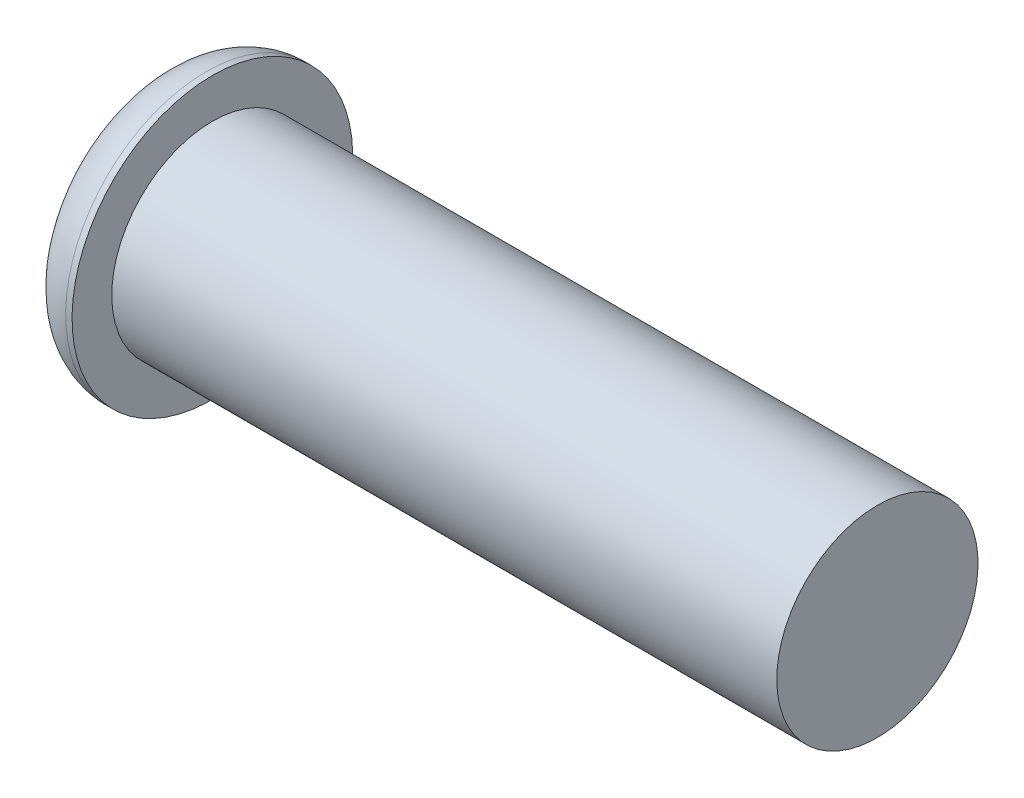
ISO-10303-21;
HEADER;
FILE_DESCRIPTION(('STEP AP214'),'2;1');
FILE_NAME('part.step','',(''),(''),'','','');
FILE_SCHEMA(('AUTOMOTIVE_DESIGN { 1 0 10303 214 1 1 1 1 }'));
ENDSEC;
DATA;
#1=APPLICATION_CONTEXT('core data for automotive mechanical design processes');
#2=APPLICATION_PROTOCOL_DEFINITION('international standard','automotive_design',2000,#1);
#3=PRODUCT_CONTEXT('',#1,'mechanical');
#4=PRODUCT('Part','Part','',(#3));
#5=PRODUCT_RELATED_PRODUCT_CATEGORY('part','',(#4));
#6=PRODUCT_DEFINITION_FORMATION('','',#4);
#7=PRODUCT_DEFINITION_CONTEXT('part definition',#1,'design');
#8=PRODUCT_DEFINITION('design','',#6,#7);
#9=PRODUCT_DEFINITION_SHAPE('','',#8);
#10=(LENGTH_UNIT() NAMED_UNIT(*) SI_UNIT(.MILLI.,.METRE.));
#11=(NAMED_UNIT(*) PLANE_ANGLE_UNIT() SI_UNIT($,.RADIAN.));
#12=(NAMED_UNIT(*) SI_UNIT($,.STERADIAN.) SOLID_ANGLE_UNIT());
#13=UNCERTAINTY_MEASURE_WITH_UNIT(LENGTH_MEASURE(1.E-05),#10,'distance_accuracy_value','');
#14=(GEOMETRIC_REPRESENTATION_CONTEXT(3) GLOBAL_UNCERTAINTY_ASSIGNED_CONTEXT((#13)) GLOBAL_UNIT_ASSIGNED_CONTEXT((#10,
#11,#12)) REPRESENTATION_CONTEXT('',''));
#15=CARTESIAN_POINT('',(0.,0.,0.));
#16=DIRECTION('',(0.,0.,1.));
#17=DIRECTION('',(1.,0.,0.));
#18=AXIS2_PLACEMENT_3D('',#15,#16,#17);
#19=CARTESIAN_POINT('',(289.484811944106,206.929423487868,0.));
#20=DIRECTION('',(-1.,0.,0.));
#21=DIRECTION('',(0.,-1.,0.));
#22=AXIS2_PLACEMENT_3D('',#19,#20,#21);
#23=PLANE('',#22);
#24=CARTESIAN_POINT('',(289.484811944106,205.479423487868,0.));
#25=DIRECTION('',(1.,0.,0.));
#26=DIRECTION('',(0.,1.,0.));
#27=AXIS2_PLACEMENT_3D('',#24,#25,#26);
#28=CIRCLE('',#27,2.90000000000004);
#29=CARTESIAN_POINT('',(289.484811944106,208.379423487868,0.));
#30=VERTEX_POINT('',#29);
#31=EDGE_CURVE('E51',#30,#30,#28,.T.);
#32=ORIENTED_EDGE('',*,*,#31,.F.);
#33=EDGE_LOOP('',(#32));
#34=FACE_BOUND('',#33,.T.);
#35=ADVANCED_FACE('F14',(#34),#23,.T.);
#36=CARTESIAN_POINT('',(290.984811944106,205.479423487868,0.));
#37=DIRECTION('',(1.,0.,0.));
#38=DIRECTION('',(0.,0.,-1.));
#39=AXIS2_PLACEMENT_3D('',#36,#37,#38);
#40=TOROIDAL_SURFACE('',#39,2.90000000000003,1.5);
#41=ORIENTED_EDGE('',*,*,#31,.T.);
#42=EDGE_LOOP('',(#41));
#43=FACE_BOUND('',#42,.T.);
#44=CARTESIAN_POINT('',(290.984811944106,205.479423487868,0.));
#45=DIRECTION('',(1.,0.,0.));
#46=DIRECTION('',(0.,1.,0.));
#47=AXIS2_PLACEMENT_3D('',#44,#45,#46);
#48=CIRCLE('',#47,4.40000000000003);
#49=CARTESIAN_POINT('',(290.984811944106,209.879423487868,0.));
#50=VERTEX_POINT('',#49);
#51=EDGE_CURVE('E48',#50,#50,#48,.T.);
#52=ORIENTED_EDGE('',*,*,#51,.F.);
#53=EDGE_LOOP('',(#52));
#54=FACE_BOUND('',#53,.T.);
#55=ADVANCED_FACE('F33',(#43,#54),#40,.T.);
#56=CARTESIAN_POINT('',(291.084811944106,205.479423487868,0.));
#57=DIRECTION('',(1.,0.,0.));
#58=DIRECTION('',(0.,1.,0.));
#59=AXIS2_PLACEMENT_3D('',#56,#57,#58);
#60=CYLINDRICAL_SURFACE('',#59,4.40000000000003);
#61=CARTESIAN_POINT('',(291.184811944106,205.479423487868,0.));
#62=DIRECTION('',(1.,0.,0.));
#63=DIRECTION('',(0.,1.,0.));
#64=AXIS2_PLACEMENT_3D('',#61,#62,#63);
#65=CIRCLE('',#64,4.40000000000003);
#66=CARTESIAN_POINT('',(291.184811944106,209.879423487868,0.));
#67=VERTEX_POINT('',#66);
#68=EDGE_CURVE('E18',#67,#67,#65,.T.);
#69=ORIENTED_EDGE('',*,*,#68,.F.);
#70=EDGE_LOOP('',(#69));
#71=FACE_BOUND('',#70,.T.);
#72=ORIENTED_EDGE('',*,*,#51,.T.);
#73=EDGE_LOOP('',(#72));
#74=FACE_BOUND('',#73,.T.);
#75=ADVANCED_FACE('F43',(#71,#74),#60,.T.);
#76=CARTESIAN_POINT('',(312.034811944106,207.056923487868,0.));
#77=DIRECTION('',(1.,0.,0.));
#78=DIRECTION('',(0.,0.,-1.));
#79=AXIS2_PLACEMENT_3D('',#76,#77,#78);
#80=PLANE('',#79);
#81=CARTESIAN_POINT('',(312.034811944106,205.479423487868,0.));
#82=DIRECTION('',(1.,0.,0.));
#83=DIRECTION('',(0.,1.,0.));
#84=AXIS2_PLACEMENT_3D('',#81,#82,#83);
#85=CIRCLE('',#84,3.15500000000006);
#86=CARTESIAN_POINT('',(312.034811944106,208.634423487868,0.));
#87=VERTEX_POINT('',#86);
#88=EDGE_CURVE('E22',#87,#87,#85,.F.);
#89=ORIENTED_EDGE('',*,*,#88,.F.);
#90=EDGE_LOOP('',(#89));
#91=FACE_BOUND('',#90,.T.);
#92=ADVANCED_FACE('F65',(#91),#80,.T.);
#93=CARTESIAN_POINT('',(291.184811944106,209.256923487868,0.));
#94=DIRECTION('',(1.,0.,0.));
#95=DIRECTION('',(0.,0.,-1.));
#96=AXIS2_PLACEMENT_3D('',#93,#94,#95);
#97=PLANE('',#96);
#98=ORIENTED_EDGE('',*,*,#68,.T.);
#99=EDGE_LOOP('',(#98));
#100=FACE_BOUND('',#99,.T.);
#101=CARTESIAN_POINT('',(291.184811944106,205.479423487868,0.));
#102=DIRECTION('',(1.,0.,0.));
#103=DIRECTION('',(0.,1.,0.));
#104=AXIS2_PLACEMENT_3D('',#101,#102,#103);
#105=CIRCLE('',#104,3.15500000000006);
#106=CARTESIAN_POINT('',(291.184811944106,208.634423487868,0.));
#107=VERTEX_POINT('',#106);
#108=EDGE_CURVE('E9',#107,#107,#105,.T.);
#109=ORIENTED_EDGE('',*,*,#108,.F.);
#110=EDGE_LOOP('',(#109));
#111=FACE_BOUND('',#110,.T.);
#112=ADVANCED_FACE('F71',(#100,#111),#97,.T.);
#113=CARTESIAN_POINT('',(301.609811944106,205.479423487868,0.));
#114=DIRECTION('',(1.,0.,0.));
#115=DIRECTION('',(0.,1.,0.));
#116=AXIS2_PLACEMENT_3D('',#113,#114,#115);
#117=CYLINDRICAL_SURFACE('',#116,3.15500000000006);
#118=ORIENTED_EDGE('',*,*,#88,.T.);
#119=EDGE_LOOP('',(#118));
#120=FACE_BOUND('',#119,.T.);
#121=ORIENTED_EDGE('',*,*,#108,.T.);
#122=EDGE_LOOP('',(#121));
#123=FACE_BOUND('',#122,.T.);
#124=ADVANCED_FACE('F74',(#120,#123),#117,.T.);
#125=CLOSED_SHELL('',(#35,#55,#75,#92,#112,#124));
#126=MANIFOLD_SOLID_BREP('B1',#125);
#127=ADVANCED_BREP_SHAPE_REPRESENTATION('',(#18,#126),#14);
#128=SHAPE_DEFINITION_REPRESENTATION(#9,#127);
ENDSEC;
END-ISO-10303-21;
